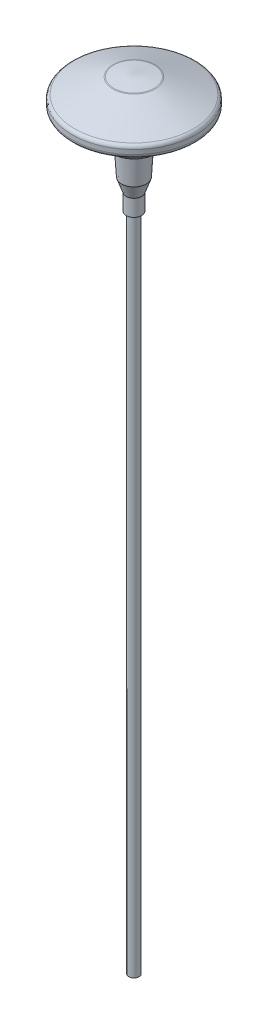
ISO-10303-21;
HEADER;
FILE_DESCRIPTION(('STEP AP214'),'2;1');
FILE_NAME('part.step','',(''),(''),'','','');
FILE_SCHEMA(('AUTOMOTIVE_DESIGN { 1 0 10303 214 1 1 1 1 }'));
ENDSEC;
DATA;
#1=APPLICATION_CONTEXT('core data for automotive mechanical design processes');
#2=APPLICATION_PROTOCOL_DEFINITION('international standard','automotive_design',2000,#1);
#3=PRODUCT_CONTEXT('',#1,'mechanical');
#4=PRODUCT('Part','Part','',(#3));
#5=PRODUCT_RELATED_PRODUCT_CATEGORY('part','',(#4));
#6=PRODUCT_DEFINITION_FORMATION('','',#4);
#7=PRODUCT_DEFINITION_CONTEXT('part definition',#1,'design');
#8=PRODUCT_DEFINITION('design','',#6,#7);
#9=PRODUCT_DEFINITION_SHAPE('','',#8);
#10=(LENGTH_UNIT() NAMED_UNIT(*) SI_UNIT(.MILLI.,.METRE.));
#11=(NAMED_UNIT(*) PLANE_ANGLE_UNIT() SI_UNIT($,.RADIAN.));
#12=(NAMED_UNIT(*) SI_UNIT($,.STERADIAN.) SOLID_ANGLE_UNIT());
#13=UNCERTAINTY_MEASURE_WITH_UNIT(LENGTH_MEASURE(1.E-05),#10,'distance_accuracy_value','');
#14=(GEOMETRIC_REPRESENTATION_CONTEXT(3) GLOBAL_UNCERTAINTY_ASSIGNED_CONTEXT((#13)) GLOBAL_UNIT_ASSIGNED_CONTEXT((#10,
#11,#12)) REPRESENTATION_CONTEXT('',''));
#15=CARTESIAN_POINT('',(0.,0.,0.));
#16=DIRECTION('',(0.,0.,1.));
#17=DIRECTION('',(1.,0.,0.));
#18=AXIS2_PLACEMENT_3D('',#15,#16,#17);
#19=CARTESIAN_POINT('',(0.,-73.4877498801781,0.));
#20=DIRECTION('',(0.,1.,0.));
#21=DIRECTION('',(0.,0.,1.));
#22=AXIS2_PLACEMENT_3D('',#19,#20,#21);
#23=PLANE('',#22);
#24=CARTESIAN_POINT('',(0.,-73.4877498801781,0.));
#25=DIRECTION('',(0.,1.,0.));
#26=DIRECTION('',(0.,0.,1.));
#27=AXIS2_PLACEMENT_3D('',#24,#25,#26);
#28=CIRCLE('',#27,4.7752);
#29=CARTESIAN_POINT('',(0.,-73.4877498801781,4.7752));
#30=VERTEX_POINT('',#29);
#31=EDGE_CURVE('E84',#30,#30,#28,.T.);
#32=ORIENTED_EDGE('',*,*,#31,.F.);
#33=EDGE_LOOP('',(#32));
#34=FACE_BOUND('',#33,.T.);
#35=CARTESIAN_POINT('',(0.,-73.4877498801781,0.));
#36=DIRECTION('',(0.,-1.,0.));
#37=DIRECTION('',(0.,0.,-1.));
#38=AXIS2_PLACEMENT_3D('',#35,#36,#37);
#39=CIRCLE('',#38,3.175);
#40=CARTESIAN_POINT('',(0.,-73.4877498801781,-3.175));
#41=VERTEX_POINT('',#40);
#42=EDGE_CURVE('E11',#41,#41,#39,.T.);
#43=ORIENTED_EDGE('',*,*,#42,.F.);
#44=EDGE_LOOP('',(#43));
#45=FACE_BOUND('',#44,.T.);
#46=ADVANCED_FACE('F32',(#34,#45),#23,.F.);
#47=CARTESIAN_POINT('',(0.,-1.86116910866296,0.));
#48=DIRECTION('',(0.,-1.,0.));
#49=DIRECTION('',(0.,0.,-1.));
#50=AXIS2_PLACEMENT_3D('',#47,#48,#49);
#51=CONICAL_SURFACE('',#50,12.4077940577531,1.4219063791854);
#52=CARTESIAN_POINT('',(0.,0.,0.));
#53=VERTEX_POINT('',#52);
#54=VERTEX_LOOP('',#53);
#55=FACE_BOUND('',#54,.T.);
#56=CARTESIAN_POINT('',(0.,-1.86116910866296,0.));
#57=DIRECTION('',(0.,1.,0.));
#58=DIRECTION('',(0.,0.,1.));
#59=AXIS2_PLACEMENT_3D('',#56,#57,#58);
#60=CIRCLE('',#59,12.4077940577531);
#61=CARTESIAN_POINT('',(0.,-1.86116910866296,12.4077940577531));
#62=VERTEX_POINT('',#61);
#63=EDGE_CURVE('E36',#62,#62,#60,.T.);
#64=ORIENTED_EDGE('',*,*,#63,.T.);
#65=EDGE_LOOP('',(#64));
#66=FACE_BOUND('',#65,.T.);
#67=ADVANCED_FACE('F34',(#55,#66),#51,.T.);
#68=CARTESIAN_POINT('',(0.,-4.37306744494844,0.));
#69=DIRECTION('',(0.,1.,0.));
#70=DIRECTION('',(0.,0.,1.));
#71=AXIS2_PLACEMENT_3D('',#68,#69,#70);
#72=TOROIDAL_SURFACE('',#71,12.0310093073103,2.54);
#73=ORIENTED_EDGE('',*,*,#63,.F.);
#74=EDGE_LOOP('',(#73));
#75=FACE_BOUND('',#74,.T.);
#76=CARTESIAN_POINT('',(0.,-2.01473665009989,0.));
#77=DIRECTION('',(0.,1.,0.));
#78=DIRECTION('',(0.,0.,1.));
#79=AXIS2_PLACEMENT_3D('',#76,#77,#78);
#80=CIRCLE('',#79,12.9743416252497);
#81=CARTESIAN_POINT('',(0.,-2.01473665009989,12.9743416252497));
#82=VERTEX_POINT('',#81);
#83=EDGE_CURVE('E49',#82,#82,#80,.T.);
#84=ORIENTED_EDGE('',*,*,#83,.T.);
#85=EDGE_LOOP('',(#84));
#86=FACE_BOUND('',#85,.T.);
#87=ADVANCED_FACE('F45',(#75,#86),#72,.T.);
#88=CARTESIAN_POINT('',(0.,-11.4263329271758,0.));
#89=DIRECTION('',(0.,-1.,0.));
#90=DIRECTION('',(0.,0.,-1.));
#91=AXIS2_PLACEMENT_3D('',#88,#89,#90);
#92=CONICAL_SURFACE('',#91,36.5033323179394,1.19028994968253);
#93=ORIENTED_EDGE('',*,*,#83,.F.);
#94=EDGE_LOOP('',(#93));
#95=FACE_BOUND('',#94,.T.);
#96=CARTESIAN_POINT('',(0.,-11.4263329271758,0.));
#97=DIRECTION('',(0.,1.,0.));
#98=DIRECTION('',(0.,0.,1.));
#99=AXIS2_PLACEMENT_3D('',#96,#97,#98);
#100=CIRCLE('',#99,36.5033323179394);
#101=CARTESIAN_POINT('',(0.,-11.4263329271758,36.5033323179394));
#102=VERTEX_POINT('',#101);
#103=EDGE_CURVE('E51',#102,#102,#100,.T.);
#104=ORIENTED_EDGE('',*,*,#103,.T.);
#105=EDGE_LOOP('',(#104));
#106=FACE_BOUND('',#105,.T.);
#107=ADVANCED_FACE('F146',(#95,#106),#92,.T.);
#108=CARTESIAN_POINT('',(0.,-13.7846637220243,0.));
#109=DIRECTION('',(0.,1.,0.));
#110=DIRECTION('',(0.,0.,1.));
#111=AXIS2_PLACEMENT_3D('',#108,#109,#110);
#112=TOROIDAL_SURFACE('',#111,35.56,2.54);
#113=ORIENTED_EDGE('',*,*,#103,.F.);
#114=EDGE_LOOP('',(#113));
#115=FACE_BOUND('',#114,.T.);
#116=CARTESIAN_POINT('',(0.,-13.7846637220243,0.));
#117=DIRECTION('',(0.,1.,0.));
#118=DIRECTION('',(0.,0.,1.));
#119=AXIS2_PLACEMENT_3D('',#116,#117,#118);
#120=CIRCLE('',#119,38.1);
#121=CARTESIAN_POINT('',(0.,-13.7846637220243,38.1));
#122=VERTEX_POINT('',#121);
#123=EDGE_CURVE('E55',#122,#122,#120,.T.);
#124=ORIENTED_EDGE('',*,*,#123,.T.);
#125=EDGE_LOOP('',(#124));
#126=FACE_BOUND('',#125,.T.);
#127=ADVANCED_FACE('F142',(#115,#126),#112,.T.);
#128=CARTESIAN_POINT('',(0.,23.9080702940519,0.));
#129=DIRECTION('',(0.,1.,0.));
#130=DIRECTION('',(0.,0.,1.));
#131=AXIS2_PLACEMENT_3D('',#128,#129,#130);
#132=CYLINDRICAL_SURFACE('',#131,38.1);
#133=ORIENTED_EDGE('',*,*,#123,.F.);
#134=EDGE_LOOP('',(#133));
#135=FACE_BOUND('',#134,.T.);
#136=CARTESIAN_POINT('',(0.,-16.4744978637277,0.));
#137=DIRECTION('',(0.,1.,0.));
#138=DIRECTION('',(0.,0.,1.));
#139=AXIS2_PLACEMENT_3D('',#136,#137,#138);
#140=CIRCLE('',#139,38.1);
#141=CARTESIAN_POINT('',(0.,-16.4744978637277,38.1));
#142=VERTEX_POINT('',#141);
#143=EDGE_CURVE('E60',#142,#142,#140,.T.);
#144=ORIENTED_EDGE('',*,*,#143,.T.);
#145=EDGE_LOOP('',(#144));
#146=FACE_BOUND('',#145,.T.);
#147=ADVANCED_FACE('F138',(#135,#146),#132,.T.);
#148=CARTESIAN_POINT('',(0.,-16.4744978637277,0.));
#149=DIRECTION('',(0.,1.,0.));
#150=DIRECTION('',(0.,0.,1.));
#151=AXIS2_PLACEMENT_3D('',#148,#149,#150);
#152=TOROIDAL_SURFACE('',#151,35.56,2.54);
#153=ORIENTED_EDGE('',*,*,#143,.F.);
#154=EDGE_LOOP('',(#153));
#155=FACE_BOUND('',#154,.T.);
#156=CARTESIAN_POINT('',(0.,-18.925151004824,0.));
#157=DIRECTION('',(0.,1.,0.));
#158=DIRECTION('',(0.,0.,1.));
#159=AXIS2_PLACEMENT_3D('',#156,#157,#158);
#160=CIRCLE('',#159,36.2277568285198);
#161=CARTESIAN_POINT('',(0.,-18.925151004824,36.2277568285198));
#162=VERTEX_POINT('',#161);
#163=EDGE_CURVE('E63',#162,#162,#160,.T.);
#164=ORIENTED_EDGE('',*,*,#163,.T.);
#165=EDGE_LOOP('',(#164));
#166=FACE_BOUND('',#165,.T.);
#167=ADVANCED_FACE('F134',(#155,#166),#152,.T.);
#168=CARTESIAN_POINT('',(0.,-23.1859012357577,0.));
#169=DIRECTION('',(0.,1.,0.));
#170=DIRECTION('',(0.,0.,1.));
#171=AXIS2_PLACEMENT_3D('',#168,#169,#170);
#172=CONICAL_SURFACE('',#171,20.5908954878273,1.30477335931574);
#173=ORIENTED_EDGE('',*,*,#163,.F.);
#174=EDGE_LOOP('',(#173));
#175=FACE_BOUND('',#174,.T.);
#176=CARTESIAN_POINT('',(0.,-23.1859012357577,0.));
#177=DIRECTION('',(0.,1.,0.));
#178=DIRECTION('',(0.,0.,1.));
#179=AXIS2_PLACEMENT_3D('',#176,#177,#178);
#180=CIRCLE('',#179,20.5908954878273);
#181=CARTESIAN_POINT('',(0.,-23.1859012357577,20.5908954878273));
#182=VERTEX_POINT('',#181);
#183=EDGE_CURVE('E66',#182,#182,#180,.T.);
#184=ORIENTED_EDGE('',*,*,#183,.T.);
#185=EDGE_LOOP('',(#184));
#186=FACE_BOUND('',#185,.T.);
#187=ADVANCED_FACE('F130',(#175,#186),#172,.T.);
#188=CARTESIAN_POINT('',(0.,-25.636554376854,0.));
#189=DIRECTION('',(0.,1.,0.));
#190=DIRECTION('',(0.,0.,1.));
#191=AXIS2_PLACEMENT_3D('',#188,#189,#190);
#192=TOROIDAL_SURFACE('',#191,21.258652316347,2.54);
#193=ORIENTED_EDGE('',*,*,#183,.F.);
#194=EDGE_LOOP('',(#193));
#195=FACE_BOUND('',#194,.T.);
#196=CARTESIAN_POINT('',(0.,-24.5598908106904,0.));
#197=DIRECTION('',(0.,1.,0.));
#198=DIRECTION('',(0.,0.,1.));
#199=AXIS2_PLACEMENT_3D('',#196,#197,#198);
#200=CIRCLE('',#199,18.9581316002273);
#201=CARTESIAN_POINT('',(0.,-24.5598908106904,18.9581316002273));
#202=VERTEX_POINT('',#201);
#203=EDGE_CURVE('E69',#202,#202,#200,.T.);
#204=ORIENTED_EDGE('',*,*,#203,.T.);
#205=EDGE_LOOP('',(#204));
#206=FACE_BOUND('',#205,.T.);
#207=ADVANCED_FACE('F126',(#195,#206),#192,.F.);
#208=CARTESIAN_POINT('',(0.,-36.195,0.));
#209=DIRECTION('',(0.,1.,0.));
#210=DIRECTION('',(0.,0.,1.));
#211=AXIS2_PLACEMENT_3D('',#208,#209,#210);
#212=CONICAL_SURFACE('',#211,13.5128,0.437728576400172);
#213=ORIENTED_EDGE('',*,*,#203,.F.);
#214=EDGE_LOOP('',(#213));
#215=FACE_BOUND('',#214,.T.);
#216=CARTESIAN_POINT('',(0.,-36.195,0.));
#217=DIRECTION('',(0.,1.,0.));
#218=DIRECTION('',(0.,0.,1.));
#219=AXIS2_PLACEMENT_3D('',#216,#217,#218);
#220=CIRCLE('',#219,13.5128);
#221=CARTESIAN_POINT('',(0.,-36.195,13.5128));
#222=VERTEX_POINT('',#221);
#223=EDGE_CURVE('E72',#222,#222,#220,.T.);
#224=ORIENTED_EDGE('',*,*,#223,.T.);
#225=EDGE_LOOP('',(#224));
#226=FACE_BOUND('',#225,.T.);
#227=ADVANCED_FACE('F122',(#215,#226),#212,.T.);
#228=CARTESIAN_POINT('',(8.7376,-36.195,0.));
#229=DIRECTION('',(0.,1.,0.));
#230=DIRECTION('',(0.,0.,1.));
#231=AXIS2_PLACEMENT_3D('',#228,#229,#230);
#232=PLANE('',#231);
#233=ORIENTED_EDGE('',*,*,#223,.F.);
#234=EDGE_LOOP('',(#233));
#235=FACE_BOUND('',#234,.T.);
#236=CARTESIAN_POINT('',(0.,-36.195,0.));
#237=DIRECTION('',(0.,1.,0.));
#238=DIRECTION('',(0.,0.,1.));
#239=AXIS2_PLACEMENT_3D('',#236,#237,#238);
#240=CIRCLE('',#239,8.7376);
#241=CARTESIAN_POINT('',(0.,-36.195,8.7376));
#242=VERTEX_POINT('',#241);
#243=EDGE_CURVE('E75',#242,#242,#240,.T.);
#244=ORIENTED_EDGE('',*,*,#243,.T.);
#245=EDGE_LOOP('',(#244));
#246=FACE_BOUND('',#245,.T.);
#247=ADVANCED_FACE('F118',(#235,#246),#232,.F.);
#248=CARTESIAN_POINT('',(0.,-55.245,0.));
#249=DIRECTION('',(0.,1.,0.));
#250=DIRECTION('',(0.,0.,1.));
#251=AXIS2_PLACEMENT_3D('',#248,#249,#250);
#252=CONICAL_SURFACE('',#251,7.62,0.0585994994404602);
#253=ORIENTED_EDGE('',*,*,#243,.F.);
#254=EDGE_LOOP('',(#253));
#255=FACE_BOUND('',#254,.T.);
#256=CARTESIAN_POINT('',(0.,-55.245,0.));
#257=DIRECTION('',(0.,1.,0.));
#258=DIRECTION('',(0.,0.,1.));
#259=AXIS2_PLACEMENT_3D('',#256,#257,#258);
#260=CIRCLE('',#259,7.62);
#261=CARTESIAN_POINT('',(0.,-55.245,7.62));
#262=VERTEX_POINT('',#261);
#263=EDGE_CURVE('E78',#262,#262,#260,.T.);
#264=ORIENTED_EDGE('',*,*,#263,.T.);
#265=EDGE_LOOP('',(#264));
#266=FACE_BOUND('',#265,.T.);
#267=ADVANCED_FACE('F114',(#255,#266),#252,.T.);
#268=CARTESIAN_POINT('',(0.,-63.3277498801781,0.));
#269=DIRECTION('',(0.,1.,0.));
#270=DIRECTION('',(0.,0.,1.));
#271=AXIS2_PLACEMENT_3D('',#268,#269,#270);
#272=CONICAL_SURFACE('',#271,4.7752,0.338419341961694);
#273=ORIENTED_EDGE('',*,*,#263,.F.);
#274=EDGE_LOOP('',(#273));
#275=FACE_BOUND('',#274,.T.);
#276=CARTESIAN_POINT('',(0.,-63.3277498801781,0.));
#277=DIRECTION('',(0.,1.,0.));
#278=DIRECTION('',(0.,0.,1.));
#279=AXIS2_PLACEMENT_3D('',#276,#277,#278);
#280=CIRCLE('',#279,4.7752);
#281=CARTESIAN_POINT('',(0.,-63.3277498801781,4.7752));
#282=VERTEX_POINT('',#281);
#283=EDGE_CURVE('E81',#282,#282,#280,.T.);
#284=ORIENTED_EDGE('',*,*,#283,.T.);
#285=EDGE_LOOP('',(#284));
#286=FACE_BOUND('',#285,.T.);
#287=ADVANCED_FACE('F110',(#275,#286),#272,.T.);
#288=CARTESIAN_POINT('',(0.,23.9080702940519,0.));
#289=DIRECTION('',(0.,1.,0.));
#290=DIRECTION('',(0.,0.,1.));
#291=AXIS2_PLACEMENT_3D('',#288,#289,#290);
#292=CYLINDRICAL_SURFACE('',#291,4.7752);
#293=ORIENTED_EDGE('',*,*,#283,.F.);
#294=EDGE_LOOP('',(#293));
#295=FACE_BOUND('',#294,.T.);
#296=ORIENTED_EDGE('',*,*,#31,.T.);
#297=EDGE_LOOP('',(#296));
#298=FACE_BOUND('',#297,.T.);
#299=ADVANCED_FACE('F96',(#295,#298),#292,.T.);
#300=CARTESIAN_POINT('',(0.,-479.887749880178,0.));
#301=DIRECTION('',(0.,1.,0.));
#302=DIRECTION('',(-1.,0.,0.));
#303=AXIS2_PLACEMENT_3D('',#300,#301,#302);
#304=CYLINDRICAL_SURFACE('',#303,3.175);
#305=CARTESIAN_POINT('',(0.,-479.887749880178,0.));
#306=DIRECTION('',(0.,-1.,0.));
#307=DIRECTION('',(0.,0.,-1.));
#308=AXIS2_PLACEMENT_3D('',#305,#306,#307);
#309=CIRCLE('',#308,3.175);
#310=CARTESIAN_POINT('',(0.,-479.887749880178,-3.175));
#311=VERTEX_POINT('',#310);
#312=EDGE_CURVE('E87',#311,#311,#309,.T.);
#313=ORIENTED_EDGE('',*,*,#312,.F.);
#314=EDGE_LOOP('',(#313));
#315=FACE_BOUND('',#314,.T.);
#316=ORIENTED_EDGE('',*,*,#42,.T.);
#317=EDGE_LOOP('',(#316));
#318=FACE_BOUND('',#317,.T.);
#319=ADVANCED_FACE('F93',(#315,#318),#304,.T.);
#320=CARTESIAN_POINT('',(0.,-479.887749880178,0.));
#321=DIRECTION('',(0.,-1.,0.));
#322=DIRECTION('',(0.,0.,-1.));
#323=AXIS2_PLACEMENT_3D('',#320,#321,#322);
#324=PLANE('',#323);
#325=ORIENTED_EDGE('',*,*,#312,.T.);
#326=EDGE_LOOP('',(#325));
#327=FACE_BOUND('',#326,.T.);
#328=ADVANCED_FACE('F91',(#327),#324,.T.);
#329=CLOSED_SHELL('',(#46,#67,#87,#107,#127,#147,#167,#187,#207,#227,#247,#267,#287,#299,#319,#328));
#330=MANIFOLD_SOLID_BREP('B2',#329);
#331=ADVANCED_BREP_SHAPE_REPRESENTATION('',(#18,#330),#14);
#332=SHAPE_DEFINITION_REPRESENTATION(#9,#331);
ENDSEC;
END-ISO-10303-21;
